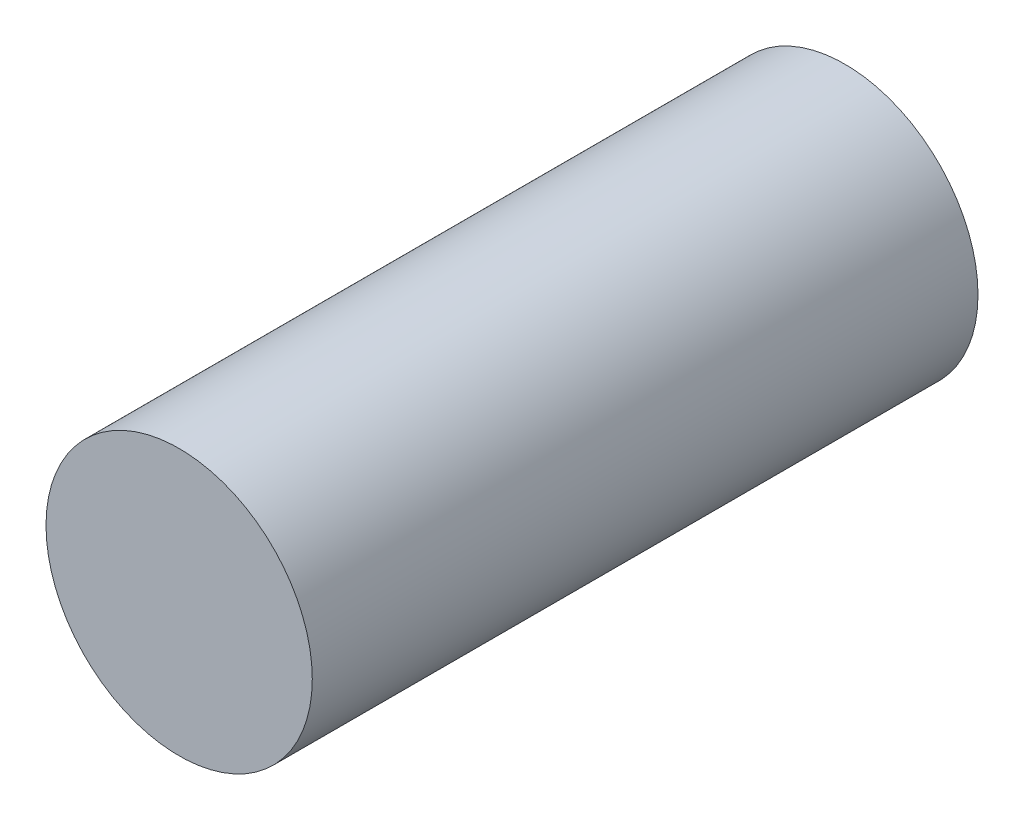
from build123d import *

# Parameters (mm, degrees)
SKETCH1_R           = 1.27
BOSS_EXTRUDE1_DEPTH = 6.35


with BuildPart() as part:
    # Sketch1 → Boss-Extrude1 (new body)
    with BuildSketch(Plane.XY):
        Circle(SKETCH1_R)
    extrude(amount=BOSS_EXTRUDE1_DEPTH)


solid = part.part
